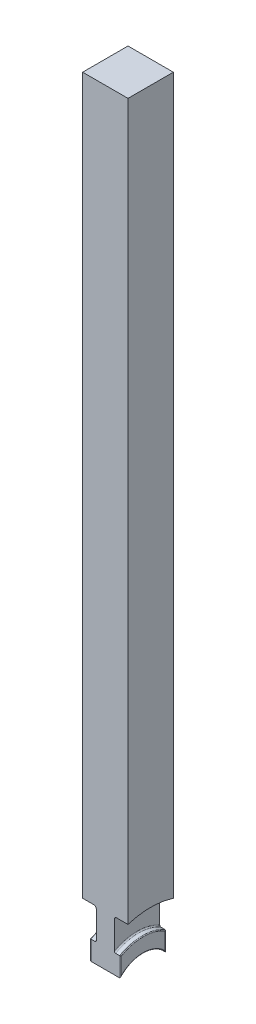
from build123d import *

# Parameters (mm, degrees)
SKETCH1_W               = 15
SKETCH1_H               = 260
BOSS_EXTRUDE1_DEPTH     = 7.5
CUT_EXTRUDE4_DEPTH      = 261.216256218
CUT_EXTRUDE4_DEPTH_BACK = 261.216256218
SKETCH8_R               = 10
SKETCH2_W               = 4.5
SKETCH2_H               = 9.5
CUT_EXTRUDE3_DEPTH      = 261.216256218
CUT_EXTRUDE3_DEPTH_BACK = 261.216256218
SKETCH7_W               = 2.5
SKETCH7_H               = 15
FILLET1_R               = 0.762
FILLET2_R               = 0.381
FILLET3_R               = 0.25


with BuildPart() as part:
    # Sketch1 → Boss-Extrude1 (new, symmetric)
    with BuildSketch(Plane(origin=(0, 0, 0), x_dir=(0, 0, -1), z_dir=(1, 0, 0))):
        with Locations((0, 130)):
            Rectangle(SKETCH1_W, SKETCH1_H)
    extrude(amount=BOSS_EXTRUDE1_DEPTH, both=True)

    # Sketch8 → Cut-Extrude4 (cut, two sides: drawn at the far end of the back side and taken through both)
    with BuildSketch(Plane(origin=(0, 0, 0), x_dir=(0, 0, -1), z_dir=(1, 0, 0)).offset(-CUT_EXTRUDE4_DEPTH_BACK)):
        Circle(SKETCH8_R)
    extrude(amount=CUT_EXTRUDE4_DEPTH + CUT_EXTRUDE4_DEPTH_BACK, mode=Mode.SUBTRACT)

    # Sketch2 → Cut-Revolve1 (revolve, cut)
    with BuildSketch(Plane.XY):
        with Locations((5.25, 19.75)):
            Rectangle(SKETCH2_W, SKETCH2_H)
        with Locations((-5.25, 19.75)):
            Rectangle(SKETCH2_W, SKETCH2_H)
    revolve(axis=Axis((-8.84822894, 0, 0), (1, 0, 0)), mode=Mode.SUBTRACT)

    # Sketch7 → Cut-Extrude3 (cut, two sides: drawn at the far end of the back side and taken through both)
    with BuildSketch(Plane.XY.offset(-CUT_EXTRUDE3_DEPTH_BACK)):
        with Locations((-6.25, 7.5)):
            Rectangle(SKETCH7_W, SKETCH7_H)
        with Locations((6.25, 7.5)):
            Rectangle(SKETCH7_W, SKETCH7_H)
    extrude(amount=CUT_EXTRUDE3_DEPTH + CUT_EXTRUDE3_DEPTH_BACK, mode=Mode.SUBTRACT)

    # Fillet1
    fillet1_edges = [part.edges().sort_by_distance(p)[0] for p in [
        (3, 24.5, 0),
        (-3, 24.5, 0),
    ]]
    fillet(fillet1_edges, radius=FILLET1_R)

    # Fillet2
    fillet2_edges = [part.edges().sort_by_distance(p)[0] for p in [
        (3, 15, 0),
        (-3, 15, 0),
    ]]
    fillet(fillet2_edges, radius=FILLET2_R)

    # Fillet3
    fillet3_edges = [part.edges().sort_by_distance(p)[0] for p in [
        (5, 15, 0),
        (-5, 15, 0),
        (-5, 10, 0),
        (-5, 9.802379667, -7.5),
        (-5, 9.802379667, 7.5),
        (5, 9.802379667, -7.5),
        (5, 10, 0),
        (5, 9.802379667, 7.5),
    ]]
    fillet(fillet3_edges, radius=FILLET3_R)


solid = part.part
